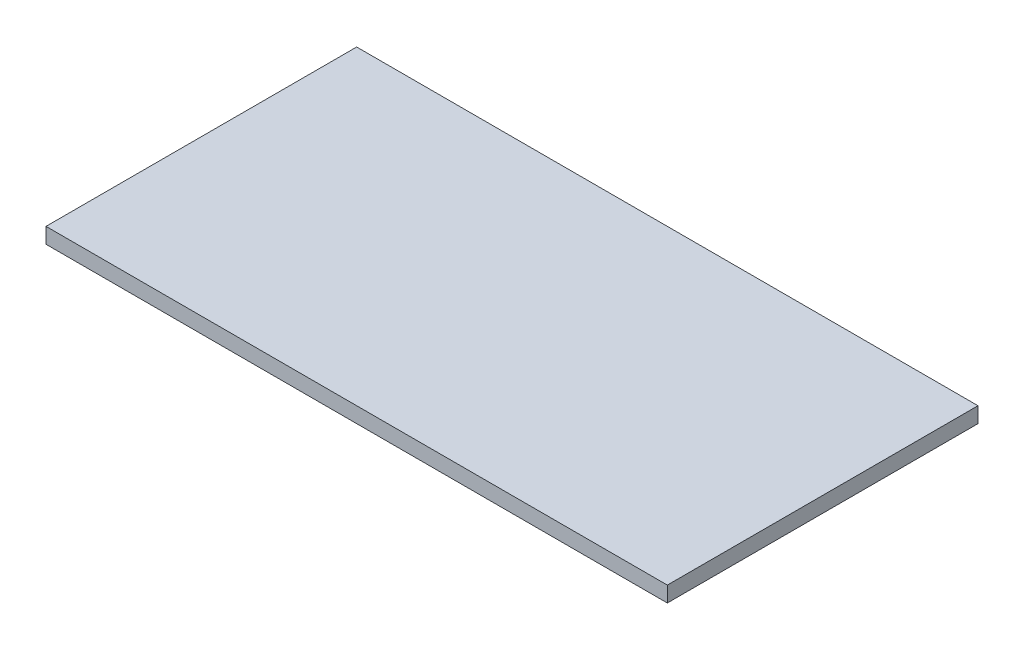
from build123d import *

# Parameters (mm, degrees)
ESQUISSE1_W        = 2000
ESQUISSE1_H        = 50
BOSS_EXTRU_1_DEPTH = 1000


with BuildPart() as part:
    # Esquisse1 → Boss.-Extru.1 (new body)
    with BuildSketch(Plane.XY):
        with Locations((1000, 25)):
            Rectangle(ESQUISSE1_W, ESQUISSE1_H)
    extrude(amount=BOSS_EXTRU_1_DEPTH)


solid = part.part
